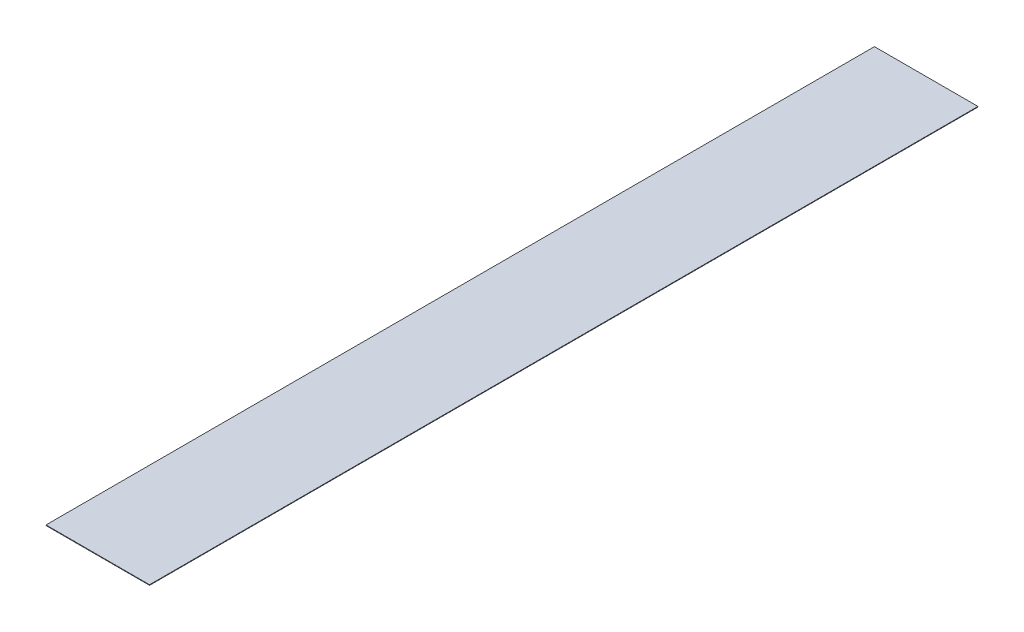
from build123d import *

# Parameters (mm, degrees)
SKETCH1_W           = 47.625
SKETCH1_H           = 381
BOSS_EXTRUDE1_DEPTH = 0.254


with BuildPart() as part:
    # Sketch1 → Boss-Extrude1 (new body)
    with BuildSketch(Plane(origin=(0, 0, 0), x_dir=(1, 0, 0), z_dir=(0, 1, 0))):
        with Locations((-23.8125, -190.5)):
            Rectangle(SKETCH1_W, SKETCH1_H)
    extrude(amount=BOSS_EXTRUDE1_DEPTH)


solid = part.part
